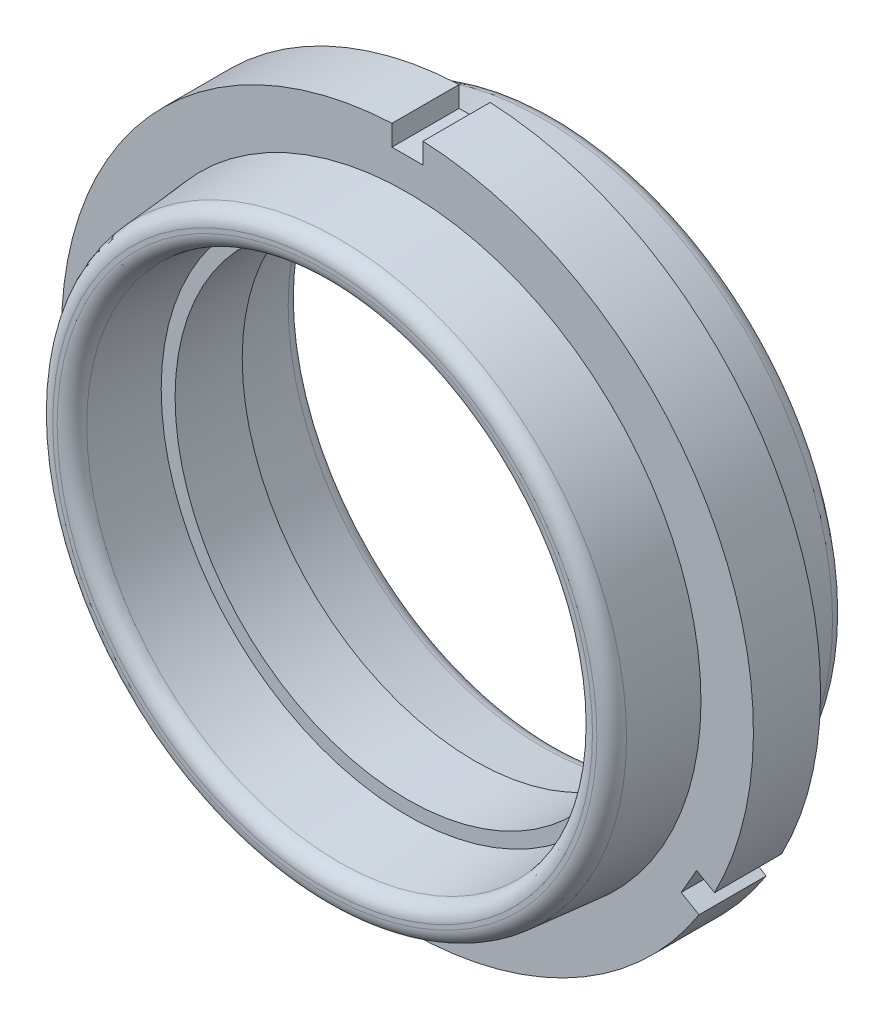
ISO-10303-21;
HEADER;
FILE_DESCRIPTION(('STEP AP214'),'2;1');
FILE_NAME('part.step','',(''),(''),'','','');
FILE_SCHEMA(('AUTOMOTIVE_DESIGN { 1 0 10303 214 1 1 1 1 }'));
ENDSEC;
DATA;
#1=APPLICATION_CONTEXT('core data for automotive mechanical design processes');
#2=APPLICATION_PROTOCOL_DEFINITION('international standard','automotive_design',2000,#1);
#3=PRODUCT_CONTEXT('',#1,'mechanical');
#4=PRODUCT('Part','Part','',(#3));
#5=PRODUCT_RELATED_PRODUCT_CATEGORY('part','',(#4));
#6=PRODUCT_DEFINITION_FORMATION('','',#4);
#7=PRODUCT_DEFINITION_CONTEXT('part definition',#1,'design');
#8=PRODUCT_DEFINITION('design','',#6,#7);
#9=PRODUCT_DEFINITION_SHAPE('','',#8);
#10=(LENGTH_UNIT() NAMED_UNIT(*) SI_UNIT(.MILLI.,.METRE.));
#11=(NAMED_UNIT(*) PLANE_ANGLE_UNIT() SI_UNIT($,.RADIAN.));
#12=(NAMED_UNIT(*) SI_UNIT($,.STERADIAN.) SOLID_ANGLE_UNIT());
#13=UNCERTAINTY_MEASURE_WITH_UNIT(LENGTH_MEASURE(1.E-05),#10,'distance_accuracy_value','');
#14=(GEOMETRIC_REPRESENTATION_CONTEXT(3) GLOBAL_UNCERTAINTY_ASSIGNED_CONTEXT((#13)) GLOBAL_UNIT_ASSIGNED_CONTEXT((#10,
#11,#12)) REPRESENTATION_CONTEXT('',''));
#15=CARTESIAN_POINT('',(0.,0.,0.));
#16=DIRECTION('',(0.,0.,1.));
#17=DIRECTION('',(1.,0.,0.));
#18=AXIS2_PLACEMENT_3D('',#15,#16,#17);
#19=CARTESIAN_POINT('',(0.,0.,0.));
#20=DIRECTION('',(0.,0.,1.));
#21=DIRECTION('',(1.,0.,0.));
#22=AXIS2_PLACEMENT_3D('',#19,#20,#21);
#23=PLANE('',#22);
#24=DIRECTION('',(-0.500000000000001,0.866025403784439,0.));
#25=VECTOR('',#24,1.);
#26=CARTESIAN_POINT('',(-56.0014053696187,-28.8683248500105,0.));
#27=LINE('',#26,#25);
#28=CARTESIAN_POINT('',(-53.0014053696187,-34.0644772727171,0.));
#29=VERTEX_POINT('',#28);
#30=CARTESIAN_POINT('',(-56.0014053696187,-28.8683248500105,0.));
#31=VERTEX_POINT('',#30);
#32=EDGE_CURVE('E44',#29,#31,#27,.T.);
#33=ORIENTED_EDGE('',*,*,#32,.T.);
#34=DIRECTION('',(-0.866025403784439,-0.499999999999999,0.));
#35=VECTOR('',#34,1.);
#36=CARTESIAN_POINT('',(-59.4655069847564,-30.8683248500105,0.));
#37=LINE('',#36,#35);
#38=CARTESIAN_POINT('',(-59.4655069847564,-30.8683248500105,0.));
#39=VERTEX_POINT('',#38);
#40=EDGE_CURVE('E129',#31,#39,#37,.T.);
#41=ORIENTED_EDGE('',*,*,#40,.T.);
#42=CARTESIAN_POINT('',(0.,0.,0.));
#43=DIRECTION('',(0.,0.,1.));
#44=DIRECTION('',(1.,0.,0.));
#45=AXIS2_PLACEMENT_3D('',#42,#43,#44);
#46=CIRCLE('',#45,67.);
#47=CARTESIAN_POINT('',(-3.,66.9328021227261,0.));
#48=VERTEX_POINT('',#47);
#49=EDGE_CURVE('E151',#48,#39,#46,.T.);
#50=ORIENTED_EDGE('',*,*,#49,.F.);
#51=DIRECTION('',(0.,-1.,0.));
#52=VECTOR('',#51,1.);
#53=CARTESIAN_POINT('',(-3.,66.9328021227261,0.));
#54=LINE('',#53,#52);
#55=CARTESIAN_POINT('',(-3.,62.932802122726,0.));
#56=VERTEX_POINT('',#55);
#57=EDGE_CURVE('E228',#48,#56,#54,.T.);
#58=ORIENTED_EDGE('',*,*,#57,.T.);
#59=DIRECTION('',(1.,0.,0.));
#60=VECTOR('',#59,1.);
#61=CARTESIAN_POINT('',(3.,62.9328021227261,0.));
#62=LINE('',#61,#60);
#63=CARTESIAN_POINT('',(3.,62.9328021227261,0.));
#64=VERTEX_POINT('',#63);
#65=EDGE_CURVE('E225',#56,#64,#62,.T.);
#66=ORIENTED_EDGE('',*,*,#65,.T.);
#67=DIRECTION('',(0.,1.,0.));
#68=VECTOR('',#67,1.);
#69=CARTESIAN_POINT('',(3.,66.9328021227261,0.));
#70=LINE('',#69,#68);
#71=CARTESIAN_POINT('',(3.,66.9328021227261,0.));
#72=VERTEX_POINT('',#71);
#73=EDGE_CURVE('E217',#64,#72,#70,.T.);
#74=ORIENTED_EDGE('',*,*,#73,.T.);
#75=CARTESIAN_POINT('',(59.4655069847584,-30.8683248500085,0.));
#76=VERTEX_POINT('',#75);
#77=EDGE_CURVE('E207',#76,#72,#46,.T.);
#78=ORIENTED_EDGE('',*,*,#77,.F.);
#79=DIRECTION('',(-0.866025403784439,0.5,0.));
#80=VECTOR('',#79,1.);
#81=CARTESIAN_POINT('',(59.4655069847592,-30.8683248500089,0.));
#82=LINE('',#81,#80);
#83=CARTESIAN_POINT('',(56.0014053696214,-28.8683248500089,0.));
#84=VERTEX_POINT('',#83);
#85=EDGE_CURVE('E52',#76,#84,#82,.T.);
#86=ORIENTED_EDGE('',*,*,#85,.T.);
#87=DIRECTION('',(-0.500000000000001,-0.866025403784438,0.));
#88=VECTOR('',#87,1.);
#89=CARTESIAN_POINT('',(53.0014053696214,-34.0644772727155,0.));
#90=LINE('',#89,#88);
#91=CARTESIAN_POINT('',(53.0014053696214,-34.0644772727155,0.));
#92=VERTEX_POINT('',#91);
#93=EDGE_CURVE('E250',#84,#92,#90,.T.);
#94=ORIENTED_EDGE('',*,*,#93,.T.);
#95=DIRECTION('',(0.866025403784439,-0.499999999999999,0.));
#96=VECTOR('',#95,1.);
#97=CARTESIAN_POINT('',(56.4655069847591,-36.0644772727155,0.));
#98=LINE('',#97,#96);
#99=CARTESIAN_POINT('',(56.4655069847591,-36.0644772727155,0.));
#100=VERTEX_POINT('',#99);
#101=EDGE_CURVE('E243',#92,#100,#98,.T.);
#102=ORIENTED_EDGE('',*,*,#101,.T.);
#103=CARTESIAN_POINT('',(-56.4655069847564,-36.0644772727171,0.));
#104=VERTEX_POINT('',#103);
#105=EDGE_CURVE('E209',#104,#100,#46,.T.);
#106=ORIENTED_EDGE('',*,*,#105,.F.);
#107=DIRECTION('',(0.866025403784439,0.499999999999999,0.));
#108=VECTOR('',#107,1.);
#109=CARTESIAN_POINT('',(-56.4655069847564,-36.0644772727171,0.));
#110=LINE('',#109,#108);
#111=EDGE_CURVE('E124',#104,#29,#110,.T.);
#112=ORIENTED_EDGE('',*,*,#111,.T.);
#113=EDGE_LOOP('',(#33,#41,#50,#58,#66,#74,#78,#86,#94,#102,#106,#112));
#114=FACE_BOUND('',#113,.T.);
#115=CARTESIAN_POINT('',(0.,0.,0.));
#116=DIRECTION('',(0.,0.,1.));
#117=DIRECTION('',(1.,0.,0.));
#118=AXIS2_PLACEMENT_3D('',#115,#116,#117);
#119=CIRCLE('',#118,57.219872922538);
#120=CARTESIAN_POINT('',(57.219872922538,0.,0.));
#121=VERTEX_POINT('',#120);
#122=EDGE_CURVE('E157',#121,#121,#119,.F.);
#123=ORIENTED_EDGE('',*,*,#122,.F.);
#124=EDGE_LOOP('',(#123));
#125=FACE_BOUND('',#124,.T.);
#126=ADVANCED_FACE('F29',(#114,#125),#23,.F.);
#127=CARTESIAN_POINT('',(0.,0.,13.));
#128=DIRECTION('',(0.,0.,1.));
#129=DIRECTION('',(1.,0.,0.));
#130=AXIS2_PLACEMENT_3D('',#127,#128,#129);
#131=PLANE('',#130);
#132=DIRECTION('',(-0.866025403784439,-0.499999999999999,0.));
#133=VECTOR('',#132,1.);
#134=CARTESIAN_POINT('',(-59.4655069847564,-30.8683248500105,13.));
#135=LINE('',#134,#133);
#136=CARTESIAN_POINT('',(-56.0014053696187,-28.8683248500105,13.));
#137=VERTEX_POINT('',#136);
#138=CARTESIAN_POINT('',(-59.4655069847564,-30.8683248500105,13.));
#139=VERTEX_POINT('',#138);
#140=EDGE_CURVE('E272',#137,#139,#135,.T.);
#141=ORIENTED_EDGE('',*,*,#140,.F.);
#142=DIRECTION('',(-0.500000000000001,0.866025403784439,0.));
#143=VECTOR('',#142,1.);
#144=CARTESIAN_POINT('',(-56.0014053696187,-28.8683248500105,13.));
#145=LINE('',#144,#143);
#146=CARTESIAN_POINT('',(-53.0014053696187,-34.0644772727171,13.));
#147=VERTEX_POINT('',#146);
#148=EDGE_CURVE('E139',#147,#137,#145,.T.);
#149=ORIENTED_EDGE('',*,*,#148,.F.);
#150=DIRECTION('',(0.866025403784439,0.499999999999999,0.));
#151=VECTOR('',#150,1.);
#152=CARTESIAN_POINT('',(-56.4655069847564,-36.0644772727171,13.));
#153=LINE('',#152,#151);
#154=CARTESIAN_POINT('',(-56.4655069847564,-36.0644772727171,13.));
#155=VERTEX_POINT('',#154);
#156=EDGE_CURVE('E121',#155,#147,#153,.T.);
#157=ORIENTED_EDGE('',*,*,#156,.F.);
#158=CARTESIAN_POINT('',(0.,0.,13.));
#159=DIRECTION('',(0.,0.,1.));
#160=DIRECTION('',(1.,0.,0.));
#161=AXIS2_PLACEMENT_3D('',#158,#159,#160);
#162=CIRCLE('',#161,67.);
#163=CARTESIAN_POINT('',(56.4655069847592,-36.0644772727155,13.));
#164=VERTEX_POINT('',#163);
#165=EDGE_CURVE('E136',#155,#164,#162,.T.);
#166=ORIENTED_EDGE('',*,*,#165,.T.);
#167=DIRECTION('',(0.866025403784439,-0.499999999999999,0.));
#168=VECTOR('',#167,1.);
#169=CARTESIAN_POINT('',(56.4655069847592,-36.0644772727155,13.));
#170=LINE('',#169,#168);
#171=CARTESIAN_POINT('',(53.0014053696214,-34.0644772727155,13.));
#172=VERTEX_POINT('',#171);
#173=EDGE_CURVE('E254',#172,#164,#170,.T.);
#174=ORIENTED_EDGE('',*,*,#173,.F.);
#175=DIRECTION('',(-0.500000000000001,-0.866025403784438,0.));
#176=VECTOR('',#175,1.);
#177=CARTESIAN_POINT('',(53.0014053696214,-34.0644772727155,13.));
#178=LINE('',#177,#176);
#179=CARTESIAN_POINT('',(56.0014053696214,-28.8683248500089,13.));
#180=VERTEX_POINT('',#179);
#181=EDGE_CURVE('E256',#180,#172,#178,.T.);
#182=ORIENTED_EDGE('',*,*,#181,.F.);
#183=DIRECTION('',(-0.866025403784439,0.5,0.));
#184=VECTOR('',#183,1.);
#185=CARTESIAN_POINT('',(59.4655069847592,-30.8683248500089,13.));
#186=LINE('',#185,#184);
#187=CARTESIAN_POINT('',(59.4655069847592,-30.8683248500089,13.));
#188=VERTEX_POINT('',#187);
#189=EDGE_CURVE('E259',#188,#180,#186,.T.);
#190=ORIENTED_EDGE('',*,*,#189,.F.);
#191=CARTESIAN_POINT('',(3.,66.9328021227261,13.));
#192=VERTEX_POINT('',#191);
#193=EDGE_CURVE('E147',#188,#192,#162,.T.);
#194=ORIENTED_EDGE('',*,*,#193,.T.);
#195=DIRECTION('',(0.,1.,0.));
#196=VECTOR('',#195,1.);
#197=CARTESIAN_POINT('',(3.,66.9328021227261,13.));
#198=LINE('',#197,#196);
#199=CARTESIAN_POINT('',(3.,62.9328021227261,13.));
#200=VERTEX_POINT('',#199);
#201=EDGE_CURVE('E231',#200,#192,#198,.T.);
#202=ORIENTED_EDGE('',*,*,#201,.F.);
#203=DIRECTION('',(1.,0.,0.));
#204=VECTOR('',#203,1.);
#205=CARTESIAN_POINT('',(3.,62.9328021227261,13.));
#206=LINE('',#205,#204);
#207=CARTESIAN_POINT('',(-3.,62.932802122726,13.));
#208=VERTEX_POINT('',#207);
#209=EDGE_CURVE('E234',#208,#200,#206,.T.);
#210=ORIENTED_EDGE('',*,*,#209,.F.);
#211=DIRECTION('',(0.,-1.,0.));
#212=VECTOR('',#211,1.);
#213=CARTESIAN_POINT('',(-3.,66.9328021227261,13.));
#214=LINE('',#213,#212);
#215=CARTESIAN_POINT('',(-3.,66.9328021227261,13.));
#216=VERTEX_POINT('',#215);
#217=EDGE_CURVE('E237',#216,#208,#214,.T.);
#218=ORIENTED_EDGE('',*,*,#217,.F.);
#219=EDGE_CURVE('E146',#216,#139,#162,.T.);
#220=ORIENTED_EDGE('',*,*,#219,.T.);
#221=EDGE_LOOP('',(#141,#149,#157,#166,#174,#182,#190,#194,#202,#210,#218,#220));
#222=FACE_BOUND('',#221,.T.);
#223=CARTESIAN_POINT('',(0.,0.,13.));
#224=DIRECTION('',(0.,0.,1.));
#225=DIRECTION('',(1.,0.,0.));
#226=AXIS2_PLACEMENT_3D('',#223,#224,#225);
#227=CIRCLE('',#226,56.8392759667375);
#228=CARTESIAN_POINT('',(56.8392759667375,0.,13.));
#229=VERTEX_POINT('',#228);
#230=EDGE_CURVE('E140',#229,#229,#227,.T.);
#231=ORIENTED_EDGE('',*,*,#230,.F.);
#232=EDGE_LOOP('',(#231));
#233=FACE_BOUND('',#232,.T.);
#234=ADVANCED_FACE('F133',(#222,#233),#131,.T.);
#235=CARTESIAN_POINT('',(0.,0.,13.));
#236=DIRECTION('',(0.,0.,-1.));
#237=DIRECTION('',(-1.,0.,0.));
#238=AXIS2_PLACEMENT_3D('',#235,#236,#237);
#239=CYLINDRICAL_SURFACE('',#238,67.);
#240=ORIENTED_EDGE('',*,*,#49,.T.);
#241=DIRECTION('',(0.,0.,1.));
#242=VECTOR('',#241,1.);
#243=CARTESIAN_POINT('',(-59.4655069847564,-30.8683248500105,0.));
#244=LINE('',#243,#242);
#245=EDGE_CURVE('E261',#39,#139,#244,.T.);
#246=ORIENTED_EDGE('',*,*,#245,.T.);
#247=ORIENTED_EDGE('',*,*,#219,.F.);
#248=DIRECTION('',(0.,0.,1.));
#249=VECTOR('',#248,1.);
#250=CARTESIAN_POINT('',(-3.,66.9328021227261,0.));
#251=LINE('',#250,#249);
#252=EDGE_CURVE('E214',#48,#216,#251,.T.);
#253=ORIENTED_EDGE('',*,*,#252,.F.);
#254=EDGE_LOOP('',(#240,#246,#247,#253));
#255=FACE_BOUND('',#254,.T.);
#256=ADVANCED_FACE('F304',(#255),#239,.T.);
#257=ORIENTED_EDGE('',*,*,#165,.F.);
#258=DIRECTION('',(0.,0.,1.));
#259=VECTOR('',#258,1.);
#260=CARTESIAN_POINT('',(-56.4655069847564,-36.0644772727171,0.));
#261=LINE('',#260,#259);
#262=EDGE_CURVE('E118',#104,#155,#261,.T.);
#263=ORIENTED_EDGE('',*,*,#262,.F.);
#264=ORIENTED_EDGE('',*,*,#105,.T.);
#265=DIRECTION('',(0.,0.,1.));
#266=VECTOR('',#265,1.);
#267=CARTESIAN_POINT('',(56.4655069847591,-36.0644772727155,0.));
#268=LINE('',#267,#266);
#269=EDGE_CURVE('E145',#100,#164,#268,.T.);
#270=ORIENTED_EDGE('',*,*,#269,.T.);
#271=EDGE_LOOP('',(#257,#263,#264,#270));
#272=FACE_BOUND('',#271,.T.);
#273=ADVANCED_FACE('F143',(#272),#239,.T.);
#274=CARTESIAN_POINT('',(0.,0.,13.));
#275=DIRECTION('',(0.,0.,1.));
#276=DIRECTION('',(1.,0.,0.));
#277=AXIS2_PLACEMENT_3D('',#274,#275,#276);
#278=CIRCLE('',#277,47.6896061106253);
#279=CARTESIAN_POINT('',(47.6896061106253,0.,13.));
#280=VERTEX_POINT('',#279);
#281=EDGE_CURVE('E150',#280,#280,#278,.F.);
#282=ORIENTED_EDGE('',*,*,#281,.F.);
#283=EDGE_LOOP('',(#282));
#284=FACE_BOUND('',#283,.T.);
#285=CARTESIAN_POINT('',(0.,0.,13.));
#286=DIRECTION('',(0.,0.,1.));
#287=DIRECTION('',(1.,0.,0.));
#288=AXIS2_PLACEMENT_3D('',#285,#286,#287);
#289=CIRCLE('',#288,45.);
#290=CARTESIAN_POINT('',(-45.,0.,13.));
#291=VERTEX_POINT('',#290);
#292=EDGE_CURVE('E205',#291,#291,#289,.T.);
#293=ORIENTED_EDGE('',*,*,#292,.F.);
#294=EDGE_LOOP('',(#293));
#295=FACE_BOUND('',#294,.T.);
#296=ADVANCED_FACE('F199',(#284,#295),#131,.T.);
#297=CARTESIAN_POINT('',(0.,0.,0.));
#298=DIRECTION('',(0.,0.,-1.));
#299=DIRECTION('',(-1.,0.,0.));
#300=AXIS2_PLACEMENT_3D('',#297,#298,#299);
#301=CIRCLE('',#300,48.1976190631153);
#302=CARTESIAN_POINT('',(-48.1976190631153,0.,0.));
#303=VERTEX_POINT('',#302);
#304=EDGE_CURVE('E277',#303,#303,#301,.T.);
#305=ORIENTED_EDGE('',*,*,#304,.T.);
#306=EDGE_LOOP('',(#305));
#307=FACE_BOUND('',#306,.T.);
#308=CARTESIAN_POINT('',(0.,0.,0.));
#309=DIRECTION('',(0.,0.,1.));
#310=DIRECTION('',(1.,0.,0.));
#311=AXIS2_PLACEMENT_3D('',#308,#309,#310);
#312=CIRCLE('',#311,45.);
#313=CARTESIAN_POINT('',(-45.,0.,0.));
#314=VERTEX_POINT('',#313);
#315=EDGE_CURVE('E208',#314,#314,#312,.T.);
#316=ORIENTED_EDGE('',*,*,#315,.T.);
#317=EDGE_LOOP('',(#316));
#318=FACE_BOUND('',#317,.T.);
#319=ADVANCED_FACE('F202',(#307,#318),#23,.F.);
#320=ORIENTED_EDGE('',*,*,#193,.F.);
#321=DIRECTION('',(0.,0.,1.));
#322=VECTOR('',#321,1.);
#323=CARTESIAN_POINT('',(59.4655069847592,-30.8683248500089,0.));
#324=LINE('',#323,#322);
#325=EDGE_CURVE('E240',#76,#188,#324,.T.);
#326=ORIENTED_EDGE('',*,*,#325,.F.);
#327=ORIENTED_EDGE('',*,*,#77,.T.);
#328=DIRECTION('',(0.,0.,1.));
#329=VECTOR('',#328,1.);
#330=CARTESIAN_POINT('',(3.,66.9328021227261,0.));
#331=LINE('',#330,#329);
#332=EDGE_CURVE('E211',#72,#192,#331,.T.);
#333=ORIENTED_EDGE('',*,*,#332,.T.);
#334=EDGE_LOOP('',(#320,#326,#327,#333));
#335=FACE_BOUND('',#334,.T.);
#336=ADVANCED_FACE('F31',(#335),#239,.T.);
#337=CARTESIAN_POINT('',(0.,0.,13.));
#338=DIRECTION('',(0.,0.,-1.));
#339=DIRECTION('',(-1.,0.,0.));
#340=AXIS2_PLACEMENT_3D('',#337,#338,#339);
#341=CYLINDRICAL_SURFACE('',#340,45.);
#342=CARTESIAN_POINT('',(-45.,0.,13.));
#343=CARTESIAN_POINT('',(-45.,0.,12.8645833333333));
#344=CARTESIAN_POINT('',(-45.,0.,12.7291666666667));
#345=CARTESIAN_POINT('',(-45.,0.,12.4583333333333));
#346=CARTESIAN_POINT('',(-45.,0.,12.3229166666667));
#347=CARTESIAN_POINT('',(-45.,0.,12.0520833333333));
#348=CARTESIAN_POINT('',(-45.,0.,11.9166666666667));
#349=CARTESIAN_POINT('',(-45.,0.,11.6458333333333));
#350=CARTESIAN_POINT('',(-45.,0.,11.5104166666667));
#351=CARTESIAN_POINT('',(-45.,0.,11.2395833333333));
#352=CARTESIAN_POINT('',(-45.,0.,11.1041666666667));
#353=CARTESIAN_POINT('',(-45.,0.,10.8333333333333));
#354=CARTESIAN_POINT('',(-45.,0.,10.6979166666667));
#355=CARTESIAN_POINT('',(-45.,0.,10.4270833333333));
#356=CARTESIAN_POINT('',(-45.,0.,10.2916666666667));
#357=CARTESIAN_POINT('',(-45.,0.,10.0208333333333));
#358=CARTESIAN_POINT('',(-45.,0.,9.88541666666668));
#359=CARTESIAN_POINT('',(-45.,0.,9.61458333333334));
#360=CARTESIAN_POINT('',(-45.,0.,9.47916666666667));
#361=CARTESIAN_POINT('',(-45.,0.,9.20833333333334));
#362=CARTESIAN_POINT('',(-45.,0.,9.07291666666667));
#363=CARTESIAN_POINT('',(-45.,0.,8.80208333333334));
#364=CARTESIAN_POINT('',(-45.,0.,8.66666666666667));
#365=CARTESIAN_POINT('',(-45.,0.,8.39583333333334));
#366=CARTESIAN_POINT('',(-45.,0.,8.26041666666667));
#367=CARTESIAN_POINT('',(-45.,0.,7.98958333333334));
#368=CARTESIAN_POINT('',(-45.,0.,7.85416666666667));
#369=CARTESIAN_POINT('',(-45.,0.,7.58333333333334));
#370=CARTESIAN_POINT('',(-45.,0.,7.44791666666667));
#371=CARTESIAN_POINT('',(-45.,0.,7.17708333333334));
#372=CARTESIAN_POINT('',(-45.,0.,7.04166666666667));
#373=CARTESIAN_POINT('',(-45.,0.,6.77083333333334));
#374=CARTESIAN_POINT('',(-45.,0.,6.63541666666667));
#375=CARTESIAN_POINT('',(-45.,0.,6.36458333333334));
#376=CARTESIAN_POINT('',(-45.,0.,6.22916666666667));
#377=CARTESIAN_POINT('',(-45.,0.,5.95833333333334));
#378=CARTESIAN_POINT('',(-45.,0.,5.82291666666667));
#379=CARTESIAN_POINT('',(-45.,0.,5.55208333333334));
#380=CARTESIAN_POINT('',(-45.,0.,5.41666666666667));
#381=CARTESIAN_POINT('',(-45.,0.,5.14583333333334));
#382=CARTESIAN_POINT('',(-45.,0.,5.01041666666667));
#383=CARTESIAN_POINT('',(-45.,0.,4.73958333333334));
#384=CARTESIAN_POINT('',(-45.,0.,4.60416666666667));
#385=CARTESIAN_POINT('',(-45.,0.,4.33333333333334));
#386=CARTESIAN_POINT('',(-45.,0.,4.19791666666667));
#387=CARTESIAN_POINT('',(-45.,0.,3.92708333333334));
#388=CARTESIAN_POINT('',(-45.,0.,3.79166666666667));
#389=CARTESIAN_POINT('',(-45.,0.,3.52083333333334));
#390=CARTESIAN_POINT('',(-45.,0.,3.38541666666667));
#391=CARTESIAN_POINT('',(-45.,0.,3.11458333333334));
#392=CARTESIAN_POINT('',(-45.,0.,2.97916666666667));
#393=CARTESIAN_POINT('',(-45.,0.,2.70833333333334));
#394=CARTESIAN_POINT('',(-45.,0.,2.57291666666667));
#395=CARTESIAN_POINT('',(-45.,0.,2.30208333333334));
#396=CARTESIAN_POINT('',(-45.,0.,2.16666666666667));
#397=CARTESIAN_POINT('',(-45.,0.,1.89583333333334));
#398=CARTESIAN_POINT('',(-45.,0.,1.76041666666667));
#399=CARTESIAN_POINT('',(-45.,0.,1.48958333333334));
#400=CARTESIAN_POINT('',(-45.,0.,1.35416666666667));
#401=CARTESIAN_POINT('',(-45.,0.,1.08333333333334));
#402=CARTESIAN_POINT('',(-45.,0.,0.947916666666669));
#403=CARTESIAN_POINT('',(-45.,0.,0.677083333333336));
#404=CARTESIAN_POINT('',(-45.,0.,0.541666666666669));
#405=CARTESIAN_POINT('',(-45.,0.,0.270833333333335));
#406=CARTESIAN_POINT('',(-45.,0.,0.135416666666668));
#407=CARTESIAN_POINT('',(-45.,0.,0.));
#408=B_SPLINE_CURVE_WITH_KNOTS('',3,(#342,#343,#344,#345,#346,#347,#348,#349,#350,#351,#352,
#353,#354,#355,#356,#357,#358,#359,#360,#361,#362,#363,#364,#365,#366,#367,#368,#369,#370,#371,
#372,#373,#374,#375,#376,#377,#378,#379,#380,#381,#382,#383,#384,#385,#386,#387,#388,#389,#390,
#391,#392,#393,#394,#395,#396,#397,#398,#399,#400,#401,#402,#403,#404,#405,#406,#407),
.UNSPECIFIED.,.F.,.F.,(4,2,2,2,2,2,2,2,2,2,2,2,2,2,2,2,2,2,2,2,2,2,2,2,2,2,2,2,2,2,2,2,4),(0.,
0.406249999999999,0.812499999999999,1.21875,1.625,2.03125,2.4375,2.84375,3.25,3.65625,4.0625,
4.46875,4.875,5.28125,5.6875,6.09375,6.5,6.90625,7.3125,7.71875,8.125,8.53125,8.93750000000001,
9.34375000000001,9.75000000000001,10.15625,10.5625,10.96875,11.375,11.78125,12.1875,12.59375,
13.),.UNSPECIFIED.);
#409=EDGE_CURVE('BSEAM311',#291,#314,#408,.T.);
#410=ORIENTED_EDGE('',*,*,#292,.T.);
#411=ORIENTED_EDGE('',*,*,#315,.F.);
#412=ORIENTED_EDGE('',*,*,#409,.T.);
#413=ORIENTED_EDGE('',*,*,#409,.F.);
#414=EDGE_LOOP('',(#410,#412,#411,#413));
#415=FACE_BOUND('',#414,.T.);
#416=ADVANCED_FACE('F311',(#415),#341,.F.);
#417=CARTESIAN_POINT('',(3.,66.9328021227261,0.));
#418=DIRECTION('',(1.,0.,0.));
#419=DIRECTION('',(0.,1.,0.));
#420=AXIS2_PLACEMENT_3D('',#417,#418,#419);
#421=PLANE('',#420);
#422=ORIENTED_EDGE('',*,*,#201,.T.);
#423=ORIENTED_EDGE('',*,*,#332,.F.);
#424=ORIENTED_EDGE('',*,*,#73,.F.);
#425=DIRECTION('',(0.,0.,1.));
#426=VECTOR('',#425,1.);
#427=CARTESIAN_POINT('',(3.,62.9328021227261,0.));
#428=LINE('',#427,#426);
#429=EDGE_CURVE('E219',#64,#200,#428,.T.);
#430=ORIENTED_EDGE('',*,*,#429,.T.);
#431=EDGE_LOOP('',(#422,#423,#424,#430));
#432=FACE_BOUND('',#431,.T.);
#433=ADVANCED_FACE('F316',(#432),#421,.F.);
#434=CARTESIAN_POINT('',(3.,62.9328021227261,0.));
#435=DIRECTION('',(0.,-1.,0.));
#436=DIRECTION('',(0.,0.,-1.));
#437=AXIS2_PLACEMENT_3D('',#434,#435,#436);
#438=PLANE('',#437);
#439=ORIENTED_EDGE('',*,*,#209,.T.);
#440=ORIENTED_EDGE('',*,*,#429,.F.);
#441=ORIENTED_EDGE('',*,*,#65,.F.);
#442=DIRECTION('',(0.,0.,1.));
#443=VECTOR('',#442,1.);
#444=CARTESIAN_POINT('',(-3.,62.932802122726,0.));
#445=LINE('',#444,#443);
#446=EDGE_CURVE('E216',#56,#208,#445,.T.);
#447=ORIENTED_EDGE('',*,*,#446,.T.);
#448=EDGE_LOOP('',(#439,#440,#441,#447));
#449=FACE_BOUND('',#448,.T.);
#450=ADVANCED_FACE('F352',(#449),#438,.F.);
#451=CARTESIAN_POINT('',(-3.,66.9328021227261,0.));
#452=DIRECTION('',(-1.,0.,0.));
#453=DIRECTION('',(0.,-1.,0.));
#454=AXIS2_PLACEMENT_3D('',#451,#452,#453);
#455=PLANE('',#454);
#456=ORIENTED_EDGE('',*,*,#217,.T.);
#457=ORIENTED_EDGE('',*,*,#446,.F.);
#458=ORIENTED_EDGE('',*,*,#57,.F.);
#459=ORIENTED_EDGE('',*,*,#252,.T.);
#460=EDGE_LOOP('',(#456,#457,#458,#459));
#461=FACE_BOUND('',#460,.T.);
#462=ADVANCED_FACE('F363',(#461),#455,.F.);
#463=CARTESIAN_POINT('',(56.4655069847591,-36.0644772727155,0.));
#464=DIRECTION('',(-0.499999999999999,-0.866025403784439,0.));
#465=DIRECTION('',(0.866025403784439,-0.499999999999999,0.));
#466=AXIS2_PLACEMENT_3D('',#463,#464,#465);
#467=PLANE('',#466);
#468=ORIENTED_EDGE('',*,*,#173,.T.);
#469=ORIENTED_EDGE('',*,*,#269,.F.);
#470=ORIENTED_EDGE('',*,*,#101,.F.);
#471=DIRECTION('',(0.,0.,1.));
#472=VECTOR('',#471,1.);
#473=CARTESIAN_POINT('',(53.0014053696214,-34.0644772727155,0.));
#474=LINE('',#473,#472);
#475=EDGE_CURVE('E245',#92,#172,#474,.T.);
#476=ORIENTED_EDGE('',*,*,#475,.T.);
#477=EDGE_LOOP('',(#468,#469,#470,#476));
#478=FACE_BOUND('',#477,.T.);
#479=ADVANCED_FACE('F373',(#478),#467,.F.);
#480=CARTESIAN_POINT('',(53.0014053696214,-34.0644772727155,0.));
#481=DIRECTION('',(-0.866025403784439,0.500000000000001,0.));
#482=DIRECTION('',(-0.500000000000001,-0.866025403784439,0.));
#483=AXIS2_PLACEMENT_3D('',#480,#481,#482);
#484=PLANE('',#483);
#485=ORIENTED_EDGE('',*,*,#181,.T.);
#486=ORIENTED_EDGE('',*,*,#475,.F.);
#487=ORIENTED_EDGE('',*,*,#93,.F.);
#488=DIRECTION('',(0.,0.,1.));
#489=VECTOR('',#488,1.);
#490=CARTESIAN_POINT('',(56.0014053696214,-28.8683248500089,0.));
#491=LINE('',#490,#489);
#492=EDGE_CURVE('E242',#84,#180,#491,.T.);
#493=ORIENTED_EDGE('',*,*,#492,.T.);
#494=EDGE_LOOP('',(#485,#486,#487,#493));
#495=FACE_BOUND('',#494,.T.);
#496=ADVANCED_FACE('F383',(#495),#484,.F.);
#497=CARTESIAN_POINT('',(59.4655069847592,-30.8683248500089,0.));
#498=DIRECTION('',(0.5,0.866025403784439,0.));
#499=DIRECTION('',(-0.866025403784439,0.5,0.));
#500=AXIS2_PLACEMENT_3D('',#497,#498,#499);
#501=PLANE('',#500);
#502=ORIENTED_EDGE('',*,*,#189,.T.);
#503=ORIENTED_EDGE('',*,*,#492,.F.);
#504=ORIENTED_EDGE('',*,*,#85,.F.);
#505=ORIENTED_EDGE('',*,*,#325,.T.);
#506=EDGE_LOOP('',(#502,#503,#504,#505));
#507=FACE_BOUND('',#506,.T.);
#508=ADVANCED_FACE('F393',(#507),#501,.F.);
#509=CARTESIAN_POINT('',(-59.4655069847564,-30.8683248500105,0.));
#510=DIRECTION('',(-0.499999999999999,0.866025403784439,0.));
#511=DIRECTION('',(-0.866025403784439,-0.5,0.));
#512=AXIS2_PLACEMENT_3D('',#509,#510,#511);
#513=PLANE('',#512);
#514=ORIENTED_EDGE('',*,*,#140,.T.);
#515=ORIENTED_EDGE('',*,*,#245,.F.);
#516=ORIENTED_EDGE('',*,*,#40,.F.);
#517=DIRECTION('',(0.,0.,1.));
#518=VECTOR('',#517,1.);
#519=CARTESIAN_POINT('',(-56.0014053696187,-28.8683248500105,0.));
#520=LINE('',#519,#518);
#521=EDGE_CURVE('E264',#31,#137,#520,.T.);
#522=ORIENTED_EDGE('',*,*,#521,.T.);
#523=EDGE_LOOP('',(#514,#515,#516,#522));
#524=FACE_BOUND('',#523,.T.);
#525=ADVANCED_FACE('F403',(#524),#513,.F.);
#526=CARTESIAN_POINT('',(-56.0014053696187,-28.8683248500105,0.));
#527=DIRECTION('',(0.866025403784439,0.500000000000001,0.));
#528=DIRECTION('',(-0.500000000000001,0.866025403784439,0.));
#529=AXIS2_PLACEMENT_3D('',#526,#527,#528);
#530=PLANE('',#529);
#531=ORIENTED_EDGE('',*,*,#148,.T.);
#532=ORIENTED_EDGE('',*,*,#521,.F.);
#533=ORIENTED_EDGE('',*,*,#32,.F.);
#534=DIRECTION('',(0.,0.,1.));
#535=VECTOR('',#534,1.);
#536=CARTESIAN_POINT('',(-53.0014053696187,-34.0644772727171,0.));
#537=LINE('',#536,#535);
#538=EDGE_CURVE('E128',#29,#147,#537,.T.);
#539=ORIENTED_EDGE('',*,*,#538,.T.);
#540=EDGE_LOOP('',(#531,#532,#533,#539));
#541=FACE_BOUND('',#540,.T.);
#542=ADVANCED_FACE('F412',(#541),#530,.F.);
#543=CARTESIAN_POINT('',(-56.4655069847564,-36.0644772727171,0.));
#544=DIRECTION('',(0.499999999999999,-0.866025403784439,0.));
#545=DIRECTION('',(0.866025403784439,0.5,0.));
#546=AXIS2_PLACEMENT_3D('',#543,#544,#545);
#547=PLANE('',#546);
#548=ORIENTED_EDGE('',*,*,#156,.T.);
#549=ORIENTED_EDGE('',*,*,#538,.F.);
#550=ORIENTED_EDGE('',*,*,#111,.F.);
#551=ORIENTED_EDGE('',*,*,#262,.T.);
#552=EDGE_LOOP('',(#548,#549,#550,#551));
#553=FACE_BOUND('',#552,.T.);
#554=ADVANCED_FACE('F120',(#553),#547,.F.);
#555=CARTESIAN_POINT('',(0.,0.,29.));
#556=DIRECTION('',(0.,0.,1.));
#557=DIRECTION('',(1.,0.,0.));
#558=AXIS2_PLACEMENT_3D('',#555,#556,#557);
#559=PLANE('',#558);
#560=CARTESIAN_POINT('',(0.,0.,29.));
#561=DIRECTION('',(0.,0.,1.));
#562=DIRECTION('',(1.,0.,0.));
#563=AXIS2_PLACEMENT_3D('',#560,#561,#562);
#564=CIRCLE('',#563,51.8384182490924);
#565=CARTESIAN_POINT('',(51.8384182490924,0.,29.));
#566=VERTEX_POINT('',#565);
#567=EDGE_CURVE('E37',#566,#566,#564,.F.);
#568=ORIENTED_EDGE('',*,*,#567,.T.);
#569=EDGE_LOOP('',(#568));
#570=FACE_BOUND('',#569,.T.);
#571=CARTESIAN_POINT('',(0.,0.,29.));
#572=DIRECTION('',(0.,0.,1.));
#573=DIRECTION('',(1.,0.,0.));
#574=AXIS2_PLACEMENT_3D('',#571,#572,#573);
#575=CIRCLE('',#574,52.6904638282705);
#576=CARTESIAN_POINT('',(52.6904638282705,0.,29.));
#577=VERTEX_POINT('',#576);
#578=EDGE_CURVE('E175',#577,#577,#575,.T.);
#579=ORIENTED_EDGE('',*,*,#578,.T.);
#580=EDGE_LOOP('',(#579));
#581=FACE_BOUND('',#580,.T.);
#582=ADVANCED_FACE('F180',(#570,#581),#559,.T.);
#583=CARTESIAN_POINT('',(0.,0.,13.));
#584=DIRECTION('',(0.,0.,-1.));
#585=DIRECTION('',(1.,0.,0.));
#586=AXIS2_PLACEMENT_3D('',#583,#584,#585);
#587=CONICAL_SURFACE('',#586,56.8392759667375,0.0872664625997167);
#588=CARTESIAN_POINT('',(0.,0.,26.261467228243));
#589=DIRECTION('',(0.,0.,-1.));
#590=DIRECTION('',(-1.,0.,0.));
#591=AXIS2_PLACEMENT_3D('',#588,#589,#590);
#592=CIRCLE('',#591,55.6790479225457);
#593=CARTESIAN_POINT('',(-55.6790479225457,0.,26.261467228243));
#594=VERTEX_POINT('',#593);
#595=EDGE_CURVE('E11',#594,#594,#592,.T.);
#596=ORIENTED_EDGE('',*,*,#595,.T.);
#597=EDGE_LOOP('',(#596));
#598=FACE_BOUND('',#597,.T.);
#599=ORIENTED_EDGE('',*,*,#230,.T.);
#600=EDGE_LOOP('',(#599));
#601=FACE_BOUND('',#600,.T.);
#602=ADVANCED_FACE('F195',(#598,#601),#587,.T.);
#603=CARTESIAN_POINT('',(0.,0.,13.));
#604=DIRECTION('',(0.,0.,1.));
#605=DIRECTION('',(1.,0.,0.));
#606=AXIS2_PLACEMENT_3D('',#603,#604,#605);
#607=CONICAL_SURFACE('',#606,47.6896061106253,0.0872664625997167);
#608=CARTESIAN_POINT('',(0.,0.,26.2614672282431));
#609=DIRECTION('',(0.,0.,-1.));
#610=DIRECTION('',(-1.,0.,0.));
#611=AXIS2_PLACEMENT_3D('',#608,#609,#610);
#612=CIRCLE('',#611,48.8498341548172);
#613=CARTESIAN_POINT('',(-48.8498341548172,0.,26.2614672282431));
#614=VERTEX_POINT('',#613);
#615=EDGE_CURVE('E172',#614,#614,#612,.F.);
#616=ORIENTED_EDGE('',*,*,#615,.T.);
#617=EDGE_LOOP('',(#616));
#618=FACE_BOUND('',#617,.T.);
#619=ORIENTED_EDGE('',*,*,#281,.T.);
#620=EDGE_LOOP('',(#619));
#621=FACE_BOUND('',#620,.T.);
#622=ADVANCED_FACE('F191',(#618,#621),#607,.F.);
#623=CARTESIAN_POINT('',(0.,0.,-16.));
#624=DIRECTION('',(0.,0.,-1.));
#625=DIRECTION('',(-1.,0.,0.));
#626=AXIS2_PLACEMENT_3D('',#623,#624,#625);
#627=PLANE('',#626);
#628=CARTESIAN_POINT('',(0.,0.,-16.));
#629=DIRECTION('',(0.,0.,-1.));
#630=DIRECTION('',(-1.,0.,0.));
#631=AXIS2_PLACEMENT_3D('',#628,#629,#630);
#632=CIRCLE('',#631,52.3464312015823);
#633=CARTESIAN_POINT('',(-52.3464312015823,0.,-16.));
#634=VERTEX_POINT('',#633);
#635=EDGE_CURVE('E166',#634,#634,#632,.F.);
#636=ORIENTED_EDGE('',*,*,#635,.T.);
#637=EDGE_LOOP('',(#636));
#638=FACE_BOUND('',#637,.T.);
#639=CARTESIAN_POINT('',(0.,0.,-16.));
#640=DIRECTION('',(0.,0.,-1.));
#641=DIRECTION('',(-1.,0.,0.));
#642=AXIS2_PLACEMENT_3D('',#639,#640,#641);
#643=CIRCLE('',#642,53.0710607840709);
#644=CARTESIAN_POINT('',(-53.0710607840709,0.,-16.));
#645=VERTEX_POINT('',#644);
#646=EDGE_CURVE('E163',#645,#645,#643,.T.);
#647=ORIENTED_EDGE('',*,*,#646,.T.);
#648=EDGE_LOOP('',(#647));
#649=FACE_BOUND('',#648,.T.);
#650=ADVANCED_FACE('F194',(#638,#649),#627,.T.);
#651=CARTESIAN_POINT('',(0.,0.,0.));
#652=DIRECTION('',(0.,0.,1.));
#653=DIRECTION('',(-1.,0.,0.));
#654=AXIS2_PLACEMENT_3D('',#651,#652,#653);
#655=CONICAL_SURFACE('',#654,57.219872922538,0.0872664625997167);
#656=CARTESIAN_POINT('',(0.,0.,-13.261467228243));
#657=DIRECTION('',(0.,0.,1.));
#658=DIRECTION('',(1.,0.,0.));
#659=AXIS2_PLACEMENT_3D('',#656,#657,#658);
#660=CIRCLE('',#659,56.0596448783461);
#661=CARTESIAN_POINT('',(56.0596448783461,0.,-13.261467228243));
#662=VERTEX_POINT('',#661);
#663=EDGE_CURVE('E169',#662,#662,#660,.T.);
#664=ORIENTED_EDGE('',*,*,#663,.T.);
#665=EDGE_LOOP('',(#664));
#666=FACE_BOUND('',#665,.T.);
#667=ORIENTED_EDGE('',*,*,#122,.T.);
#668=EDGE_LOOP('',(#667));
#669=FACE_BOUND('',#668,.T.);
#670=ADVANCED_FACE('F286',(#666,#669),#655,.T.);
#671=CARTESIAN_POINT('',(0.,0.,0.));
#672=DIRECTION('',(0.,0.,-1.));
#673=DIRECTION('',(-1.,0.,0.));
#674=AXIS2_PLACEMENT_3D('',#671,#672,#673);
#675=CONICAL_SURFACE('',#674,48.1976190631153,0.0872664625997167);
#676=CARTESIAN_POINT('',(0.,0.,-13.2614672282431));
#677=DIRECTION('',(0.,0.,1.));
#678=DIRECTION('',(1.,0.,0.));
#679=AXIS2_PLACEMENT_3D('',#676,#677,#678);
#680=CIRCLE('',#679,49.3578471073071);
#681=CARTESIAN_POINT('',(49.3578471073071,0.,-13.2614672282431));
#682=VERTEX_POINT('',#681);
#683=EDGE_CURVE('E160',#682,#682,#680,.F.);
#684=ORIENTED_EDGE('',*,*,#683,.T.);
#685=EDGE_LOOP('',(#684));
#686=FACE_BOUND('',#685,.T.);
#687=ORIENTED_EDGE('',*,*,#304,.F.);
#688=EDGE_LOOP('',(#687));
#689=FACE_BOUND('',#688,.T.);
#690=ADVANCED_FACE('F283',(#686,#689),#675,.F.);
#691=CARTESIAN_POINT('',(0.,0.,-13.));
#692=DIRECTION('',(0.,0.,-1.));
#693=DIRECTION('',(-1.,0.,0.));
#694=AXIS2_PLACEMENT_3D('',#691,#692,#693);
#695=TOROIDAL_SURFACE('',#694,52.3464312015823,3.);
#696=ORIENTED_EDGE('',*,*,#635,.F.);
#697=EDGE_LOOP('',(#696));
#698=FACE_BOUND('',#697,.T.);
#699=ORIENTED_EDGE('',*,*,#683,.F.);
#700=EDGE_LOOP('',(#699));
#701=FACE_BOUND('',#700,.T.);
#702=ADVANCED_FACE('F285',(#698,#701),#695,.T.);
#703=CARTESIAN_POINT('',(0.,0.,-13.));
#704=DIRECTION('',(0.,0.,-1.));
#705=DIRECTION('',(-1.,0.,0.));
#706=AXIS2_PLACEMENT_3D('',#703,#704,#705);
#707=TOROIDAL_SURFACE('',#706,53.0710607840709,3.);
#708=ORIENTED_EDGE('',*,*,#663,.F.);
#709=EDGE_LOOP('',(#708));
#710=FACE_BOUND('',#709,.T.);
#711=ORIENTED_EDGE('',*,*,#646,.F.);
#712=EDGE_LOOP('',(#711));
#713=FACE_BOUND('',#712,.T.);
#714=ADVANCED_FACE('F187',(#710,#713),#707,.T.);
#715=CARTESIAN_POINT('',(0.,0.,26.));
#716=DIRECTION('',(0.,0.,1.));
#717=DIRECTION('',(1.,0.,0.));
#718=AXIS2_PLACEMENT_3D('',#715,#716,#717);
#719=TOROIDAL_SURFACE('',#718,51.8384182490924,3.);
#720=ORIENTED_EDGE('',*,*,#567,.F.);
#721=EDGE_LOOP('',(#720));
#722=FACE_BOUND('',#721,.T.);
#723=ORIENTED_EDGE('',*,*,#615,.F.);
#724=EDGE_LOOP('',(#723));
#725=FACE_BOUND('',#724,.T.);
#726=ADVANCED_FACE('F183',(#722,#725),#719,.T.);
#727=CARTESIAN_POINT('',(0.,0.,26.));
#728=DIRECTION('',(0.,0.,1.));
#729=DIRECTION('',(1.,0.,0.));
#730=AXIS2_PLACEMENT_3D('',#727,#728,#729);
#731=TOROIDAL_SURFACE('',#730,52.6904638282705,3.);
#732=ORIENTED_EDGE('',*,*,#595,.F.);
#733=EDGE_LOOP('',(#732));
#734=FACE_BOUND('',#733,.T.);
#735=ORIENTED_EDGE('',*,*,#578,.F.);
#736=EDGE_LOOP('',(#735));
#737=FACE_BOUND('',#736,.T.);
#738=ADVANCED_FACE('F186',(#734,#737),#731,.T.);
#739=CLOSED_SHELL('',(#126,#234,#256,#273,#296,#319,#336,#416,#433,#450,#462,#479,#496,#508,
#525,#542,#554,#582,#602,#622,#650,#670,#690,#702,#714,#726,#738));
#740=MANIFOLD_SOLID_BREP('B2',#739);
#741=ADVANCED_BREP_SHAPE_REPRESENTATION('',(#18,#740),#14);
#742=SHAPE_DEFINITION_REPRESENTATION(#9,#741);
ENDSEC;
END-ISO-10303-21;
